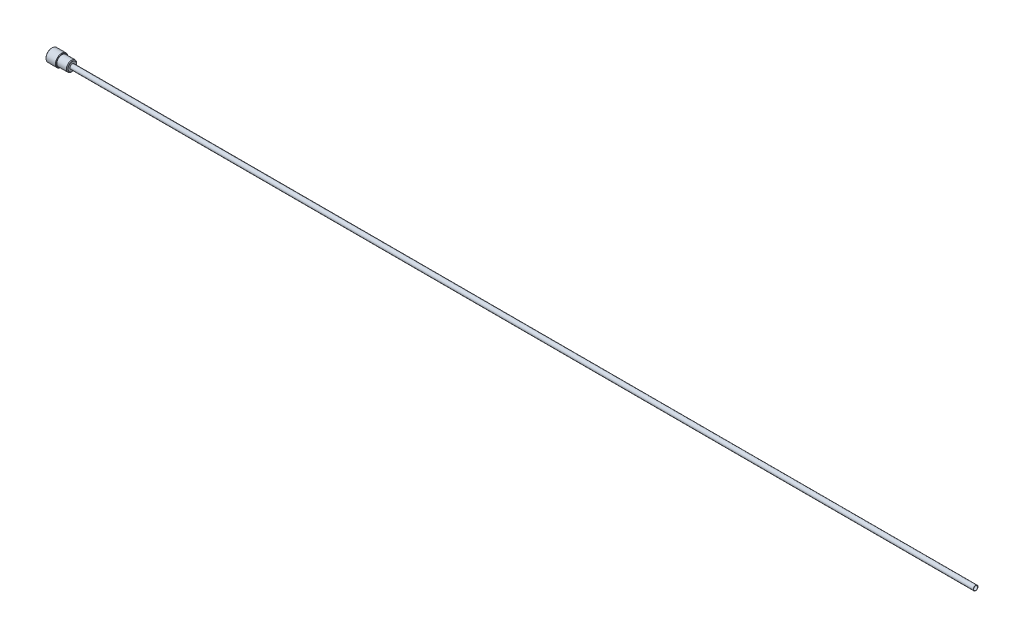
ISO-10303-21;
HEADER;
FILE_DESCRIPTION(('STEP AP214'),'2;1');
FILE_NAME('part.step','',(''),(''),'','','');
FILE_SCHEMA(('AUTOMOTIVE_DESIGN { 1 0 10303 214 1 1 1 1 }'));
ENDSEC;
DATA;
#1=APPLICATION_CONTEXT('core data for automotive mechanical design processes');
#2=APPLICATION_PROTOCOL_DEFINITION('international standard','automotive_design',2000,#1);
#3=PRODUCT_CONTEXT('',#1,'mechanical');
#4=PRODUCT('Part','Part','',(#3));
#5=PRODUCT_RELATED_PRODUCT_CATEGORY('part','',(#4));
#6=PRODUCT_DEFINITION_FORMATION('','',#4);
#7=PRODUCT_DEFINITION_CONTEXT('part definition',#1,'design');
#8=PRODUCT_DEFINITION('design','',#6,#7);
#9=PRODUCT_DEFINITION_SHAPE('','',#8);
#10=(LENGTH_UNIT() NAMED_UNIT(*) SI_UNIT(.MILLI.,.METRE.));
#11=(NAMED_UNIT(*) PLANE_ANGLE_UNIT() SI_UNIT($,.RADIAN.));
#12=(NAMED_UNIT(*) SI_UNIT($,.STERADIAN.) SOLID_ANGLE_UNIT());
#13=UNCERTAINTY_MEASURE_WITH_UNIT(LENGTH_MEASURE(1.E-05),#10,'distance_accuracy_value','');
#14=(GEOMETRIC_REPRESENTATION_CONTEXT(3) GLOBAL_UNCERTAINTY_ASSIGNED_CONTEXT((#13)) GLOBAL_UNIT_ASSIGNED_CONTEXT((#10,
#11,#12)) REPRESENTATION_CONTEXT('',''));
#15=CARTESIAN_POINT('',(0.,0.,0.));
#16=DIRECTION('',(0.,0.,1.));
#17=DIRECTION('',(1.,0.,0.));
#18=AXIS2_PLACEMENT_3D('',#15,#16,#17);
#19=CARTESIAN_POINT('',(0.300000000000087,0.,0.));
#20=DIRECTION('',(-1.,0.,0.));
#21=DIRECTION('',(0.,0.,1.));
#22=AXIS2_PLACEMENT_3D('',#19,#20,#21);
#23=CONICAL_SURFACE('',#22,2.,0.785398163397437);
#24=CARTESIAN_POINT('',(-0.000200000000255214,1.98396647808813,-1.16395749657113));
#25=CARTESIAN_POINT('',(0.0384307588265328,1.9161781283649,-1.20309511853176));
#26=CARTESIAN_POINT('',(0.0747491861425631,1.8472660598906,-1.24288151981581));
#27=CARTESIAN_POINT('',(0.141169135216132,1.70680265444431,-1.32397810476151));
#28=CARTESIAN_POINT('',(0.171234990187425,1.63523877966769,-1.36529552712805));
#29=CARTESIAN_POINT('',(0.222691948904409,1.49094484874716,-1.44860366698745));
#30=CARTESIAN_POINT('',(0.24420866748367,1.41824935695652,-1.49057442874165));
#31=CARTESIAN_POINT('',(0.277313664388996,1.27130498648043,-1.57541280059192));
#32=CARTESIAN_POINT('',(0.288925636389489,1.19706025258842,-1.61827801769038));
#33=CARTESIAN_POINT('',(0.299422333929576,1.06830579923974,-1.6926144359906));
#34=CARTESIAN_POINT('',(0.300918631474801,1.01394984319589,-1.72399686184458));
#35=CARTESIAN_POINT('',(0.297995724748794,0.905336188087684,-1.78670498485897));
#36=CARTESIAN_POINT('',(0.293574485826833,0.851078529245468,-1.81803065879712));
#37=CARTESIAN_POINT('',(0.279068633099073,0.743085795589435,-1.88038029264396));
#38=CARTESIAN_POINT('',(0.268978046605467,0.689351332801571,-1.91140389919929));
#39=CARTESIAN_POINT('',(0.243685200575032,0.582815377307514,-1.97291246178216));
#40=CARTESIAN_POINT('',(0.228483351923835,0.530013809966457,-2.00339746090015));
#41=CARTESIAN_POINT('',(0.184480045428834,0.398001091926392,-2.07961503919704));
#42=CARTESIAN_POINT('',(0.152732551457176,0.31952408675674,-2.12492375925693));
#43=CARTESIAN_POINT('',(0.0993016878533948,0.204043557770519,-2.19159647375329));
#44=CARTESIAN_POINT('',(0.0805538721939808,0.165975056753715,-2.21357533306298));
#45=CARTESIAN_POINT('',(0.0413766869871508,0.0905142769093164,-2.25714263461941));
#46=CARTESIAN_POINT('',(0.0209481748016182,0.0531216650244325,-2.27873126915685));
#47=CARTESIAN_POINT('',(-0.00020000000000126,0.0160335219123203,-2.30014411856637));
#48=B_SPLINE_CURVE_WITH_KNOTS('',3,(#24,#25,#26,#27,#28,#29,#30,#31,#32,#33,#34,#35,#36,#37,#38,
#39,#40,#41,#42,#43,#44,#45,#46,#47),.UNSPECIFIED.,.F.,.F.,(4,2,2,2,2,2,2,2,2,2,2,4),(0.,
0.262041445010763,0.525538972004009,0.785007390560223,1.04385336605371,1.23193452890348,
1.4200803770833,1.60842481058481,1.79675410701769,2.08425218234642,2.22759444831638,
2.37086404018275),.UNSPECIFIED.);
#49=CARTESIAN_POINT('',(0.,1.98361577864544,-1.16415997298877));
#50=VERTEX_POINT('',#49);
#51=CARTESIAN_POINT('',(0.,0.0163842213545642,-2.29994164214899));
#52=VERTEX_POINT('',#51);
#53=EDGE_CURVE('E11',#50,#52,#48,.T.);
#54=ORIENTED_EDGE('',*,*,#53,.F.);
#55=CARTESIAN_POINT('',(0.,0.,0.));
#56=DIRECTION('',(1.,0.,0.));
#57=DIRECTION('',(0.,0.,-1.));
#58=AXIS2_PLACEMENT_3D('',#55,#56,#57);
#59=CIRCLE('',#58,2.30000000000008);
#60=EDGE_CURVE('E309',#52,#50,#59,.T.);
#61=ORIENTED_EDGE('',*,*,#60,.F.);
#62=EDGE_LOOP('',(#54,#61));
#63=FACE_BOUND('',#62,.T.);
#64=ADVANCED_FACE('F33',(#63),#23,.F.);
#65=CARTESIAN_POINT('',(-0.828689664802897,2.,-2.40597153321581));
#66=CARTESIAN_POINT('',(-0.783988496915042,2.,-2.347829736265));
#67=CARTESIAN_POINT('',(-0.739688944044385,2.,-2.28937422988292));
#68=CARTESIAN_POINT('',(-0.652076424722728,2.,-2.17170772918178));
#69=CARTESIAN_POINT('',(-0.608763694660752,2.,-2.11249655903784));
#70=CARTESIAN_POINT('',(-0.522999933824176,2.,-1.99275792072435));
#71=CARTESIAN_POINT('',(-0.480558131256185,2.,-1.93222382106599));
#72=CARTESIAN_POINT('',(-0.397155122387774,2.,-1.81014741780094));
#73=CARTESIAN_POINT('',(-0.356193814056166,2.,-1.74860518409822));
#74=CARTESIAN_POINT('',(-0.27355167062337,2.,-1.62040759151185));
#75=CARTESIAN_POINT('',(-0.231989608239,2.,-1.55367527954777));
#76=CARTESIAN_POINT('',(-0.151462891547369,2.,-1.41866366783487));
#77=CARTESIAN_POINT('',(-0.112497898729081,2.,-1.35038457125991));
#78=CARTESIAN_POINT('',(-0.0379762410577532,2.,-1.21223217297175));
#79=CARTESIAN_POINT('',(-0.00241004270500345,2.,-1.14236405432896));
#80=CARTESIAN_POINT('',(0.0645106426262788,2.,-1.00065507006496));
#81=CARTESIAN_POINT('',(0.0958671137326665,2.,-0.928815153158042));
#82=CARTESIAN_POINT('',(0.150419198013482,2.,-0.790157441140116));
#83=CARTESIAN_POINT('',(0.174113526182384,2.,-0.723537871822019));
#84=CARTESIAN_POINT('',(0.216169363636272,2.,-0.588604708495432));
#85=CARTESIAN_POINT('',(0.234530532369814,2.,-0.520291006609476));
#86=CARTESIAN_POINT('',(0.264621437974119,2.,-0.383565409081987));
#87=CARTESIAN_POINT('',(0.276471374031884,2.,-0.315180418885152));
#88=CARTESIAN_POINT('',(0.293293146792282,2.,-0.177564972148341));
#89=CARTESIAN_POINT('',(0.298266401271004,2.,-0.108334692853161));
#90=CARTESIAN_POINT('',(0.300913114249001,2.,0.0272578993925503));
#91=CARTESIAN_POINT('',(0.29889405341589,2.,0.0936142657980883));
#92=CARTESIAN_POINT('',(0.288372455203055,2.,0.225807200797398));
#93=CARTESIAN_POINT('',(0.279869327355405,2.,0.291643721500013));
#94=CARTESIAN_POINT('',(0.256715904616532,2.,0.423437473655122));
#95=CARTESIAN_POINT('',(0.241957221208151,2.,0.489375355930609));
#96=CARTESIAN_POINT('',(0.207107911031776,2.,0.619795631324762));
#97=CARTESIAN_POINT('',(0.187017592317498,2.,0.68427810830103));
#98=CARTESIAN_POINT('',(0.117470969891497,2.,0.882854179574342));
#99=CARTESIAN_POINT('',(0.0602832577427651,2.,1.014230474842));
#100=CARTESIAN_POINT('',(-0.0669762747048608,2.,1.27085617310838));
#101=CARTESIAN_POINT('',(-0.137093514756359,2.,1.3960819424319));
#102=CARTESIAN_POINT('',(-0.246592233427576,2.,1.57710301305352));
#103=CARTESIAN_POINT('',(-0.282799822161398,2.,1.63485696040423));
#104=CARTESIAN_POINT('',(-0.356762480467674,2.,1.74937310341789));
#105=CARTESIAN_POINT('',(-0.394517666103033,2.,1.80613522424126));
#106=CARTESIAN_POINT('',(-0.47098494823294,2.,1.91834043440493));
#107=CARTESIAN_POINT('',(-0.509686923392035,2.,1.97379045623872));
#108=CARTESIAN_POINT('',(-0.588127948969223,2.,2.08392988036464));
#109=CARTESIAN_POINT('',(-0.627866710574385,2.,2.13861948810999));
#110=CARTESIAN_POINT('',(-0.668030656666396,2.,2.19299019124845));
#111=B_SPLINE_CURVE_WITH_KNOTS('',3,(#65,#66,#67,#68,#69,#70,#71,#72,#73,#74,#75,#76,#77,#78,
#79,#80,#81,#82,#83,#84,#85,#86,#87,#88,#89,#90,#91,#92,#93,#94,#95,#96,#97,#98,#99,#100,#101,
#102,#103,#104,#105,#106,#107,#108,#109,#110),.UNSPECIFIED.,.F.,.F.,(4,2,2,2,2,2,2,2,2,2,2,2,2,
2,2,2,2,2,2,2,2,2,4),(0.,0.220022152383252,0.440096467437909,0.661868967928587,
0.883626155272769,1.11943006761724,1.35520318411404,1.59029425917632,1.82527413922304,
2.03721449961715,2.24916839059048,2.45706548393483,2.66491970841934,2.86375194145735,
3.06260228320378,3.26504876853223,3.46748355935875,3.89608923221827,4.32623026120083,
4.53070681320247,4.73519872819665,4.93804819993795,5.14084175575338),.UNSPECIFIED.);
#112=CARTESIAN_POINT('',(0.,2.,1.13578166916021));
#113=VERTEX_POINT('',#112);
#114=CARTESIAN_POINT('',(0.,2.,-1.13578166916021));
#115=VERTEX_POINT('',#114);
#116=EDGE_CURVE('E46',#113,#115,#111,.F.);
#117=ORIENTED_EDGE('',*,*,#116,.F.);
#118=EDGE_CURVE('E311',#115,#113,#59,.T.);
#119=ORIENTED_EDGE('',*,*,#118,.F.);
#120=EDGE_LOOP('',(#117,#119));
#121=FACE_BOUND('',#120,.T.);
#122=ADVANCED_FACE('F275',(#121),#23,.F.);
#123=CARTESIAN_POINT('',(-0.000200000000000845,0.016033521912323,2.30014411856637));
#124=CARTESIAN_POINT('',(0.0384307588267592,0.0838218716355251,2.26100649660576));
#125=CARTESIAN_POINT('',(0.0747491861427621,0.152733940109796,2.22122009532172));
#126=CARTESIAN_POINT('',(0.141169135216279,0.293197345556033,2.14012351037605));
#127=CARTESIAN_POINT('',(0.171234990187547,0.364761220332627,2.09880608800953));
#128=CARTESIAN_POINT('',(0.222691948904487,0.509055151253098,2.01549794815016));
#129=CARTESIAN_POINT('',(0.244208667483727,0.581750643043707,1.97352718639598));
#130=CARTESIAN_POINT('',(0.277313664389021,0.728695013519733,1.88868881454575));
#131=CARTESIAN_POINT('',(0.288925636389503,0.802939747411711,1.84582359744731));
#132=CARTESIAN_POINT('',(0.29942233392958,0.931694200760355,1.7714871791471));
#133=CARTESIAN_POINT('',(0.300918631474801,0.9860501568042,1.74010475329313));
#134=CARTESIAN_POINT('',(0.297995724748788,1.0946638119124,1.67739663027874));
#135=CARTESIAN_POINT('',(0.293574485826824,1.14892147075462,1.64607095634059));
#136=CARTESIAN_POINT('',(0.279068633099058,1.25691420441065,1.58372132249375));
#137=CARTESIAN_POINT('',(0.268978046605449,1.31064866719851,1.55269771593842));
#138=CARTESIAN_POINT('',(0.24368520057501,1.41718462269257,1.49118915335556));
#139=CARTESIAN_POINT('',(0.228483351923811,1.46998619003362,1.46070415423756));
#140=CARTESIAN_POINT('',(0.184480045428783,1.60199890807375,1.38448657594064));
#141=CARTESIAN_POINT('',(0.15273255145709,1.68047591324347,1.33917785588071));
#142=CARTESIAN_POINT('',(0.0993016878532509,1.79595644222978,1.2725051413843));
#143=CARTESIAN_POINT('',(0.0805538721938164,1.83402494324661,1.25052628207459));
#144=CARTESIAN_POINT('',(0.0413766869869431,1.90948572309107,1.20695898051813));
#145=CARTESIAN_POINT('',(0.0209481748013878,1.94687833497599,1.18537034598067));
#146=CARTESIAN_POINT('',(-0.000200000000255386,1.98396647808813,1.16395749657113));
#147=B_SPLINE_CURVE_WITH_KNOTS('',3,(#123,#124,#125,#126,#127,#128,#129,#130,#131,#132,#133,
#134,#135,#136,#137,#138,#139,#140,#141,#142,#143,#144,#145,#146),.UNSPECIFIED.,.F.,.F.,(4,2,2,
2,2,2,2,2,2,2,2,4),(0.,0.262041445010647,0.525538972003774,0.785007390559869,1.04385336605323,
1.23193452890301,1.42008037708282,1.60842481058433,1.7967541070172,2.08425218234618,
2.22759444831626,2.37086404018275),.UNSPECIFIED.);
#148=CARTESIAN_POINT('',(0.,0.0163842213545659,2.29994164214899));
#149=VERTEX_POINT('',#148);
#150=CARTESIAN_POINT('',(0.,1.98361577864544,1.16415997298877));
#151=VERTEX_POINT('',#150);
#152=EDGE_CURVE('E245',#149,#151,#147,.T.);
#153=ORIENTED_EDGE('',*,*,#152,.F.);
#154=EDGE_CURVE('E307',#151,#149,#59,.T.);
#155=ORIENTED_EDGE('',*,*,#154,.F.);
#156=EDGE_LOOP('',(#153,#155));
#157=FACE_BOUND('',#156,.T.);
#158=ADVANCED_FACE('F280',(#157),#23,.F.);
#159=CARTESIAN_POINT('',(-0.000200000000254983,-1.98396647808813,1.16395749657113));
#160=CARTESIAN_POINT('',(0.0384307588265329,-1.9161781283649,1.20309511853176));
#161=CARTESIAN_POINT('',(0.0747491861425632,-1.8472660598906,1.24288151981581));
#162=CARTESIAN_POINT('',(0.141169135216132,-1.70680265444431,1.32397810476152));
#163=CARTESIAN_POINT('',(0.171234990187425,-1.63523877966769,1.36529552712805));
#164=CARTESIAN_POINT('',(0.222691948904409,-1.49094484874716,1.44860366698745));
#165=CARTESIAN_POINT('',(0.24420866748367,-1.41824935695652,1.49057442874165));
#166=CARTESIAN_POINT('',(0.277313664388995,-1.27130498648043,1.57541280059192));
#167=CARTESIAN_POINT('',(0.288925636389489,-1.19706025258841,1.61827801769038));
#168=CARTESIAN_POINT('',(0.299422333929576,-1.06830579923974,1.69261443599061));
#169=CARTESIAN_POINT('',(0.300918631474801,-1.01394984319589,1.72399686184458));
#170=CARTESIAN_POINT('',(0.297995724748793,-0.905336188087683,1.78670498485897));
#171=CARTESIAN_POINT('',(0.293574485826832,-0.851078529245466,1.81803065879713));
#172=CARTESIAN_POINT('',(0.279068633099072,-0.743085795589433,1.88038029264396));
#173=CARTESIAN_POINT('',(0.268978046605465,-0.689351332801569,1.91140389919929));
#174=CARTESIAN_POINT('',(0.243685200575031,-0.582815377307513,1.97291246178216));
#175=CARTESIAN_POINT('',(0.228483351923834,-0.530013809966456,2.00339746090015));
#176=CARTESIAN_POINT('',(0.184480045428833,-0.398001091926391,2.07961503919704));
#177=CARTESIAN_POINT('',(0.152732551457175,-0.31952408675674,2.12492375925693));
#178=CARTESIAN_POINT('',(0.0993016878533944,-0.204043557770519,2.19159647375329));
#179=CARTESIAN_POINT('',(0.0805538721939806,-0.165975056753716,2.21357533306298));
#180=CARTESIAN_POINT('',(0.0413766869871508,-0.0905142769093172,2.25714263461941));
#181=CARTESIAN_POINT('',(0.0209481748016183,-0.0531216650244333,2.27873126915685));
#182=CARTESIAN_POINT('',(-0.000200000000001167,-0.0160335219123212,2.30014411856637));
#183=B_SPLINE_CURVE_WITH_KNOTS('',3,(#159,#160,#161,#162,#163,#164,#165,#166,#167,#168,#169,
#170,#171,#172,#173,#174,#175,#176,#177,#178,#179,#180,#181,#182),.UNSPECIFIED.,.F.,.F.,(4,2,2,
2,2,2,2,2,2,2,2,4),(0.,0.262041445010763,0.525538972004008,0.785007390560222,1.0438533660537,
1.23193452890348,1.4200803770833,1.60842481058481,1.79675410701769,2.08425218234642,
2.22759444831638,2.37086404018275),.UNSPECIFIED.);
#184=CARTESIAN_POINT('',(0.,-1.98361577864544,1.16415997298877));
#185=VERTEX_POINT('',#184);
#186=CARTESIAN_POINT('',(0.,-0.0163842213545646,2.29994164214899));
#187=VERTEX_POINT('',#186);
#188=EDGE_CURVE('E250',#185,#187,#183,.T.);
#189=ORIENTED_EDGE('',*,*,#188,.F.);
#190=EDGE_CURVE('E304',#187,#185,#59,.T.);
#191=ORIENTED_EDGE('',*,*,#190,.F.);
#192=EDGE_LOOP('',(#189,#191));
#193=FACE_BOUND('',#192,.T.);
#194=ADVANCED_FACE('F288',(#193),#23,.F.);
#195=CARTESIAN_POINT('',(-0.828689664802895,-2.,-2.4059715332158));
#196=CARTESIAN_POINT('',(-0.783988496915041,-2.,-2.34782973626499));
#197=CARTESIAN_POINT('',(-0.739688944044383,-2.,-2.28937422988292));
#198=CARTESIAN_POINT('',(-0.652076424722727,-2.,-2.17170772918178));
#199=CARTESIAN_POINT('',(-0.608763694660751,-2.,-2.11249655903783));
#200=CARTESIAN_POINT('',(-0.522999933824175,-2.,-1.99275792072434));
#201=CARTESIAN_POINT('',(-0.480558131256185,-2.,-1.93222382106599));
#202=CARTESIAN_POINT('',(-0.397155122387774,-2.,-1.81014741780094));
#203=CARTESIAN_POINT('',(-0.356193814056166,-2.,-1.74860518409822));
#204=CARTESIAN_POINT('',(-0.27355167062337,-2.,-1.62040759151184));
#205=CARTESIAN_POINT('',(-0.231989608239,-2.,-1.55367527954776));
#206=CARTESIAN_POINT('',(-0.151462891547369,-2.,-1.41866366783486));
#207=CARTESIAN_POINT('',(-0.112497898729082,-2.,-1.35038457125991));
#208=CARTESIAN_POINT('',(-0.0379762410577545,-2.,-1.21223217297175));
#209=CARTESIAN_POINT('',(-0.00241004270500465,-2.,-1.14236405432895));
#210=CARTESIAN_POINT('',(0.0645106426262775,-2.,-1.00065507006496));
#211=CARTESIAN_POINT('',(0.095867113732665,-2.,-0.928815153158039));
#212=CARTESIAN_POINT('',(0.15041919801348,-2.,-0.790157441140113));
#213=CARTESIAN_POINT('',(0.174113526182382,-2.,-0.723537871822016));
#214=CARTESIAN_POINT('',(0.21616936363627,-2.,-0.588604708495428));
#215=CARTESIAN_POINT('',(0.234530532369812,-2.,-0.520291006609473));
#216=CARTESIAN_POINT('',(0.264621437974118,-2.,-0.383565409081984));
#217=CARTESIAN_POINT('',(0.276471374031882,-2.,-0.315180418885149));
#218=CARTESIAN_POINT('',(0.29329314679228,-2.,-0.177564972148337));
#219=CARTESIAN_POINT('',(0.298266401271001,-2.,-0.108334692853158));
#220=CARTESIAN_POINT('',(0.300913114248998,-2.,0.0272578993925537));
#221=CARTESIAN_POINT('',(0.298894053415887,-2.,0.0936142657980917));
#222=CARTESIAN_POINT('',(0.288372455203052,-2.,0.225807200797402));
#223=CARTESIAN_POINT('',(0.279869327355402,-2.,0.291643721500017));
#224=CARTESIAN_POINT('',(0.256715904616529,-2.,0.423437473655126));
#225=CARTESIAN_POINT('',(0.241957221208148,-2.,0.489375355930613));
#226=CARTESIAN_POINT('',(0.207107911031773,-2.,0.619795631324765));
#227=CARTESIAN_POINT('',(0.187017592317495,-2.,0.684278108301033));
#228=CARTESIAN_POINT('',(0.117470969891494,-2.,0.882854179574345));
#229=CARTESIAN_POINT('',(0.0602832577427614,-2.,1.014230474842));
#230=CARTESIAN_POINT('',(-0.0669762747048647,-2.,1.27085617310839));
#231=CARTESIAN_POINT('',(-0.137093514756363,-2.,1.3960819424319));
#232=CARTESIAN_POINT('',(-0.24659223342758,-2.,1.57710301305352));
#233=CARTESIAN_POINT('',(-0.282799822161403,-2.,1.63485696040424));
#234=CARTESIAN_POINT('',(-0.356762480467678,-2.,1.7493731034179));
#235=CARTESIAN_POINT('',(-0.394517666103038,-2.,1.80613522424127));
#236=CARTESIAN_POINT('',(-0.470984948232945,-2.,1.91834043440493));
#237=CARTESIAN_POINT('',(-0.509686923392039,-2.,1.97379045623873));
#238=CARTESIAN_POINT('',(-0.588127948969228,-2.,2.08392988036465));
#239=CARTESIAN_POINT('',(-0.62786671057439,-2.,2.13861948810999));
#240=CARTESIAN_POINT('',(-0.668030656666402,-2.,2.19299019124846));
#241=B_SPLINE_CURVE_WITH_KNOTS('',3,(#195,#196,#197,#198,#199,#200,#201,#202,#203,#204,#205,
#206,#207,#208,#209,#210,#211,#212,#213,#214,#215,#216,#217,#218,#219,#220,#221,#222,#223,#224,
#225,#226,#227,#228,#229,#230,#231,#232,#233,#234,#235,#236,#237,#238,#239,#240),.UNSPECIFIED.,
.F.,.F.,(4,2,2,2,2,2,2,2,2,2,2,2,2,2,2,2,2,2,2,2,2,2,4),(0.,0.220022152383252,0.440096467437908,
0.661868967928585,0.883626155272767,1.11943006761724,1.35520318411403,1.59029425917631,
1.82527413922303,2.03721449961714,2.24916839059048,2.45706548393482,2.66491970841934,
2.86375194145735,3.06260228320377,3.26504876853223,3.46748355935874,3.89608923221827,
4.32623026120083,4.53070681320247,4.73519872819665,4.93804819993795,5.14084175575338),.UNSPECIFIED.);
#242=CARTESIAN_POINT('',(0.,-2.,-1.13578166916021));
#243=VERTEX_POINT('',#242);
#244=CARTESIAN_POINT('',(0.,-2.,1.13578166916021));
#245=VERTEX_POINT('',#244);
#246=EDGE_CURVE('E255',#243,#245,#241,.T.);
#247=ORIENTED_EDGE('',*,*,#246,.F.);
#248=EDGE_CURVE('E299',#245,#243,#59,.T.);
#249=ORIENTED_EDGE('',*,*,#248,.F.);
#250=EDGE_LOOP('',(#247,#249));
#251=FACE_BOUND('',#250,.T.);
#252=ADVANCED_FACE('F283',(#251),#23,.F.);
#253=CARTESIAN_POINT('',(0.,0.965199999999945,0.));
#254=DIRECTION('',(1.,0.,0.));
#255=DIRECTION('',(0.,0.,-1.));
#256=AXIS2_PLACEMENT_3D('',#253,#254,#255);
#257=PLANE('',#256);
#258=ORIENTED_EDGE('',*,*,#60,.T.);
#259=DIRECTION('',(0.,-0.866025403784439,-0.5));
#260=VECTOR('',#259,1.);
#261=CARTESIAN_POINT('',(0.,2.,-1.15470053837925));
#262=LINE('',#261,#260);
#263=CARTESIAN_POINT('',(0.,2.,-1.15470053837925));
#264=VERTEX_POINT('',#263);
#265=EDGE_CURVE('E133',#264,#50,#262,.T.);
#266=ORIENTED_EDGE('',*,*,#265,.F.);
#267=DIRECTION('',(0.,0.,-1.));
#268=VECTOR('',#267,1.);
#269=CARTESIAN_POINT('',(0.,2.,1.15470053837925));
#270=LINE('',#269,#268);
#271=EDGE_CURVE('E167',#115,#264,#270,.T.);
#272=ORIENTED_EDGE('',*,*,#271,.F.);
#273=ORIENTED_EDGE('',*,*,#118,.T.);
#274=CARTESIAN_POINT('',(0.,2.,1.15470053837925));
#275=VERTEX_POINT('',#274);
#276=EDGE_CURVE('E144',#275,#113,#270,.T.);
#277=ORIENTED_EDGE('',*,*,#276,.F.);
#278=DIRECTION('',(0.,0.866025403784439,-0.5));
#279=VECTOR('',#278,1.);
#280=CARTESIAN_POINT('',(0.,0.,2.30940107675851));
#281=LINE('',#280,#279);
#282=EDGE_CURVE('E163',#151,#275,#281,.T.);
#283=ORIENTED_EDGE('',*,*,#282,.F.);
#284=ORIENTED_EDGE('',*,*,#154,.T.);
#285=CARTESIAN_POINT('',(0.,0.,2.30940107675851));
#286=VERTEX_POINT('',#285);
#287=EDGE_CURVE('E164',#286,#149,#281,.T.);
#288=ORIENTED_EDGE('',*,*,#287,.F.);
#289=DIRECTION('',(0.,0.866025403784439,0.5));
#290=VECTOR('',#289,1.);
#291=CARTESIAN_POINT('',(0.,-2.,1.15470053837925));
#292=LINE('',#291,#290);
#293=EDGE_CURVE('E159',#187,#286,#292,.T.);
#294=ORIENTED_EDGE('',*,*,#293,.F.);
#295=ORIENTED_EDGE('',*,*,#190,.T.);
#296=CARTESIAN_POINT('',(0.,-2.,1.15470053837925));
#297=VERTEX_POINT('',#296);
#298=EDGE_CURVE('E160',#297,#185,#292,.T.);
#299=ORIENTED_EDGE('',*,*,#298,.F.);
#300=DIRECTION('',(0.,0.,1.));
#301=VECTOR('',#300,1.);
#302=CARTESIAN_POINT('',(0.,-2.,-1.15470053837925));
#303=LINE('',#302,#301);
#304=EDGE_CURVE('E151',#245,#297,#303,.T.);
#305=ORIENTED_EDGE('',*,*,#304,.F.);
#306=ORIENTED_EDGE('',*,*,#248,.T.);
#307=CARTESIAN_POINT('',(0.,-2.,-1.15470053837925));
#308=VERTEX_POINT('',#307);
#309=EDGE_CURVE('E154',#308,#243,#303,.T.);
#310=ORIENTED_EDGE('',*,*,#309,.F.);
#311=DIRECTION('',(0.,-0.866025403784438,0.5));
#312=VECTOR('',#311,1.);
#313=CARTESIAN_POINT('',(0.,0.,-2.3094010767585));
#314=LINE('',#313,#312);
#315=CARTESIAN_POINT('',(0.,-1.98361577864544,-1.16415997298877));
#316=VERTEX_POINT('',#315);
#317=EDGE_CURVE('E152',#316,#308,#314,.T.);
#318=ORIENTED_EDGE('',*,*,#317,.F.);
#319=CARTESIAN_POINT('',(0.,-0.0163842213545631,-2.29994164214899));
#320=VERTEX_POINT('',#319);
#321=EDGE_CURVE('E150',#316,#320,#59,.T.);
#322=ORIENTED_EDGE('',*,*,#321,.T.);
#323=CARTESIAN_POINT('',(0.,0.,-2.3094010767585));
#324=VERTEX_POINT('',#323);
#325=EDGE_CURVE('E139',#324,#320,#314,.T.);
#326=ORIENTED_EDGE('',*,*,#325,.F.);
#327=EDGE_CURVE('E123',#52,#324,#262,.T.);
#328=ORIENTED_EDGE('',*,*,#327,.F.);
#329=EDGE_LOOP('',(#258,#266,#272,#273,#277,#283,#284,#288,#294,#295,#299,#305,#306,#310,#318,
#322,#326,#328));
#330=FACE_BOUND('',#329,.T.);
#331=CARTESIAN_POINT('',(0.,0.,0.));
#332=DIRECTION('',(1.,0.,0.));
#333=DIRECTION('',(0.,0.,-1.));
#334=AXIS2_PLACEMENT_3D('',#331,#332,#333);
#335=CIRCLE('',#334,2.79999999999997);
#336=CARTESIAN_POINT('',(0.,0.,-2.79999999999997));
#337=VERTEX_POINT('',#336);
#338=EDGE_CURVE('E308',#337,#337,#335,.F.);
#339=ORIENTED_EDGE('',*,*,#338,.T.);
#340=EDGE_LOOP('',(#339));
#341=FACE_BOUND('',#340,.T.);
#342=ADVANCED_FACE('F146',(#330,#341),#257,.F.);
#343=CARTESIAN_POINT('',(-22.2121854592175,0.,0.));
#344=DIRECTION('',(-1.,0.,0.));
#345=DIRECTION('',(0.,0.,1.));
#346=AXIS2_PLACEMENT_3D('',#343,#344,#345);
#347=CYLINDRICAL_SURFACE('',#346,0.965199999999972);
#348=CARTESIAN_POINT('',(450.,0.,0.));
#349=DIRECTION('',(-1.,0.,0.));
#350=DIRECTION('',(0.,0.,1.));
#351=AXIS2_PLACEMENT_3D('',#348,#349,#350);
#352=CIRCLE('',#351,0.9652);
#353=CARTESIAN_POINT('',(450.,0.,0.9652));
#354=VERTEX_POINT('',#353);
#355=EDGE_CURVE('E340',#354,#354,#352,.T.);
#356=ORIENTED_EDGE('',*,*,#355,.F.);
#357=EDGE_LOOP('',(#356));
#358=FACE_BOUND('',#357,.T.);
#359=CARTESIAN_POINT('',(3.62177056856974,0.,0.));
#360=DIRECTION('',(-1.,0.,0.));
#361=DIRECTION('',(0.,0.,1.));
#362=AXIS2_PLACEMENT_3D('',#359,#360,#361);
#363=CIRCLE('',#362,0.965199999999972);
#364=CARTESIAN_POINT('',(3.62177056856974,0.,0.965199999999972));
#365=VERTEX_POINT('',#364);
#366=EDGE_CURVE('E190',#365,#365,#363,.F.);
#367=ORIENTED_EDGE('',*,*,#366,.F.);
#368=EDGE_LOOP('',(#367));
#369=FACE_BOUND('',#368,.T.);
#370=ADVANCED_FACE('F294',(#358,#369),#347,.F.);
#371=CARTESIAN_POINT('',(10.,2.05,0.));
#372=DIRECTION('',(-1.,0.,0.));
#373=DIRECTION('',(0.,0.,1.));
#374=AXIS2_PLACEMENT_3D('',#371,#372,#373);
#375=PLANE('',#374);
#376=CARTESIAN_POINT('',(10.,0.,0.));
#377=DIRECTION('',(-1.,0.,0.));
#378=DIRECTION('',(0.,0.,1.));
#379=AXIS2_PLACEMENT_3D('',#376,#377,#378);
#380=CIRCLE('',#379,2.05);
#381=CARTESIAN_POINT('',(10.,0.,2.05));
#382=VERTEX_POINT('',#381);
#383=EDGE_CURVE('E328',#382,#382,#380,.T.);
#384=ORIENTED_EDGE('',*,*,#383,.F.);
#385=EDGE_LOOP('',(#384));
#386=FACE_BOUND('',#385,.T.);
#387=CARTESIAN_POINT('',(10.,0.,0.));
#388=DIRECTION('',(-1.,0.,0.));
#389=DIRECTION('',(0.,0.,1.));
#390=AXIS2_PLACEMENT_3D('',#387,#388,#389);
#391=CIRCLE('',#390,1.143);
#392=CARTESIAN_POINT('',(10.,0.,1.143));
#393=VERTEX_POINT('',#392);
#394=EDGE_CURVE('E192',#393,#393,#391,.T.);
#395=ORIENTED_EDGE('',*,*,#394,.T.);
#396=EDGE_LOOP('',(#395));
#397=FACE_BOUND('',#396,.T.);
#398=ADVANCED_FACE('F349',(#386,#397),#375,.F.);
#399=CARTESIAN_POINT('',(-22.2121854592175,0.,0.));
#400=DIRECTION('',(-1.,0.,0.));
#401=DIRECTION('',(0.,0.,1.));
#402=AXIS2_PLACEMENT_3D('',#399,#400,#401);
#403=CYLINDRICAL_SURFACE('',#402,2.05);
#404=CARTESIAN_POINT('',(9.9,0.,0.));
#405=DIRECTION('',(-1.,0.,0.));
#406=DIRECTION('',(0.,0.,1.));
#407=AXIS2_PLACEMENT_3D('',#404,#405,#406);
#408=CIRCLE('',#407,2.05);
#409=CARTESIAN_POINT('',(9.9,0.,2.05));
#410=VERTEX_POINT('',#409);
#411=EDGE_CURVE('E331',#410,#410,#408,.T.);
#412=ORIENTED_EDGE('',*,*,#411,.F.);
#413=EDGE_LOOP('',(#412));
#414=FACE_BOUND('',#413,.T.);
#415=ORIENTED_EDGE('',*,*,#383,.T.);
#416=EDGE_LOOP('',(#415));
#417=FACE_BOUND('',#416,.T.);
#418=ADVANCED_FACE('F383',(#414,#417),#403,.T.);
#419=CARTESIAN_POINT('',(9.9,0.,0.));
#420=DIRECTION('',(-1.,0.,0.));
#421=DIRECTION('',(0.,0.,1.));
#422=AXIS2_PLACEMENT_3D('',#419,#420,#421);
#423=CONICAL_SURFACE('',#422,2.05,1.04719755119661);
#424=CARTESIAN_POINT('',(9.64019237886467,0.,0.));
#425=DIRECTION('',(-1.,0.,0.));
#426=DIRECTION('',(0.,0.,1.));
#427=AXIS2_PLACEMENT_3D('',#424,#425,#426);
#428=CIRCLE('',#427,2.5);
#429=CARTESIAN_POINT('',(9.64019237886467,0.,2.5));
#430=VERTEX_POINT('',#429);
#431=EDGE_CURVE('E334',#430,#430,#428,.T.);
#432=ORIENTED_EDGE('',*,*,#431,.F.);
#433=EDGE_LOOP('',(#432));
#434=FACE_BOUND('',#433,.T.);
#435=ORIENTED_EDGE('',*,*,#411,.T.);
#436=EDGE_LOOP('',(#435));
#437=FACE_BOUND('',#436,.T.);
#438=ADVANCED_FACE('F379',(#434,#437),#423,.T.);
#439=CARTESIAN_POINT('',(-22.2121854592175,0.,0.));
#440=DIRECTION('',(-1.,0.,0.));
#441=DIRECTION('',(0.,0.,1.));
#442=AXIS2_PLACEMENT_3D('',#439,#440,#441);
#443=CYLINDRICAL_SURFACE('',#442,2.5);
#444=CARTESIAN_POINT('',(5.,0.,0.));
#445=DIRECTION('',(-1.,0.,0.));
#446=DIRECTION('',(0.,0.,1.));
#447=AXIS2_PLACEMENT_3D('',#444,#445,#446);
#448=CIRCLE('',#447,2.5);
#449=CARTESIAN_POINT('',(5.,0.,2.5));
#450=VERTEX_POINT('',#449);
#451=EDGE_CURVE('E337',#450,#450,#448,.T.);
#452=ORIENTED_EDGE('',*,*,#451,.F.);
#453=EDGE_LOOP('',(#452));
#454=FACE_BOUND('',#453,.T.);
#455=ORIENTED_EDGE('',*,*,#431,.T.);
#456=EDGE_LOOP('',(#455));
#457=FACE_BOUND('',#456,.T.);
#458=ADVANCED_FACE('F375',(#454,#457),#443,.T.);
#459=CARTESIAN_POINT('',(5.,2.5,0.));
#460=DIRECTION('',(-1.,0.,0.));
#461=DIRECTION('',(0.,0.,1.));
#462=AXIS2_PLACEMENT_3D('',#459,#460,#461);
#463=PLANE('',#462);
#464=CARTESIAN_POINT('',(5.,0.,0.));
#465=DIRECTION('',(-1.,0.,0.));
#466=DIRECTION('',(0.,0.,1.));
#467=AXIS2_PLACEMENT_3D('',#464,#465,#466);
#468=CIRCLE('',#467,2.80000000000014);
#469=CARTESIAN_POINT('',(5.,0.,2.80000000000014));
#470=VERTEX_POINT('',#469);
#471=EDGE_CURVE('E319',#470,#470,#468,.F.);
#472=ORIENTED_EDGE('',*,*,#471,.T.);
#473=EDGE_LOOP('',(#472));
#474=FACE_BOUND('',#473,.T.);
#475=ORIENTED_EDGE('',*,*,#451,.T.);
#476=EDGE_LOOP('',(#475));
#477=FACE_BOUND('',#476,.T.);
#478=ADVANCED_FACE('F365',(#474,#477),#463,.F.);
#479=CARTESIAN_POINT('',(-22.2121854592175,0.,0.));
#480=DIRECTION('',(-1.,0.,0.));
#481=DIRECTION('',(0.,0.,1.));
#482=AXIS2_PLACEMENT_3D('',#479,#480,#481);
#483=CYLINDRICAL_SURFACE('',#482,3.);
#484=CARTESIAN_POINT('',(4.8000000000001,0.,0.));
#485=DIRECTION('',(-1.,0.,0.));
#486=DIRECTION('',(0.,0.,1.));
#487=AXIS2_PLACEMENT_3D('',#484,#485,#486);
#488=CIRCLE('',#487,3.);
#489=CARTESIAN_POINT('',(4.8000000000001,0.,3.));
#490=VERTEX_POINT('',#489);
#491=EDGE_CURVE('E322',#490,#490,#488,.T.);
#492=ORIENTED_EDGE('',*,*,#491,.T.);
#493=EDGE_LOOP('',(#492));
#494=FACE_BOUND('',#493,.T.);
#495=CARTESIAN_POINT('',(0.200000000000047,0.,0.));
#496=DIRECTION('',(1.,0.,0.));
#497=DIRECTION('',(0.,0.,-1.));
#498=AXIS2_PLACEMENT_3D('',#495,#496,#497);
#499=CIRCLE('',#498,3.);
#500=CARTESIAN_POINT('',(0.200000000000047,0.,-3.));
#501=VERTEX_POINT('',#500);
#502=EDGE_CURVE('E325',#501,#501,#499,.T.);
#503=ORIENTED_EDGE('',*,*,#502,.T.);
#504=EDGE_LOOP('',(#503));
#505=FACE_BOUND('',#504,.T.);
#506=ADVANCED_FACE('F360',(#494,#505),#483,.T.);
#507=CARTESIAN_POINT('',(450.,1.143,0.));
#508=DIRECTION('',(-1.,0.,0.));
#509=DIRECTION('',(0.,0.,1.));
#510=AXIS2_PLACEMENT_3D('',#507,#508,#509);
#511=PLANE('',#510);
#512=CARTESIAN_POINT('',(450.,0.,0.));
#513=DIRECTION('',(-1.,0.,0.));
#514=DIRECTION('',(0.,0.,1.));
#515=AXIS2_PLACEMENT_3D('',#512,#513,#514);
#516=CIRCLE('',#515,1.143);
#517=CARTESIAN_POINT('',(450.,0.,1.143));
#518=VERTEX_POINT('',#517);
#519=EDGE_CURVE('E342',#518,#518,#516,.T.);
#520=ORIENTED_EDGE('',*,*,#519,.F.);
#521=EDGE_LOOP('',(#520));
#522=FACE_BOUND('',#521,.T.);
#523=ORIENTED_EDGE('',*,*,#355,.T.);
#524=EDGE_LOOP('',(#523));
#525=FACE_BOUND('',#524,.T.);
#526=ADVANCED_FACE('F353',(#522,#525),#511,.F.);
#527=CARTESIAN_POINT('',(-22.2121854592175,0.,0.));
#528=DIRECTION('',(-1.,0.,0.));
#529=DIRECTION('',(0.,0.,1.));
#530=AXIS2_PLACEMENT_3D('',#527,#528,#529);
#531=CYLINDRICAL_SURFACE('',#530,1.143);
#532=ORIENTED_EDGE('',*,*,#394,.F.);
#533=EDGE_LOOP('',(#532));
#534=FACE_BOUND('',#533,.T.);
#535=ORIENTED_EDGE('',*,*,#519,.T.);
#536=EDGE_LOOP('',(#535));
#537=FACE_BOUND('',#536,.T.);
#538=ADVANCED_FACE('F203',(#534,#537),#531,.T.);
#539=CARTESIAN_POINT('',(4.8000000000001,0.,0.));
#540=DIRECTION('',(-1.,0.,0.));
#541=DIRECTION('',(0.,0.,1.));
#542=AXIS2_PLACEMENT_3D('',#539,#540,#541);
#543=CONICAL_SURFACE('',#542,3.,0.785398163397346);
#544=ORIENTED_EDGE('',*,*,#471,.F.);
#545=EDGE_LOOP('',(#544));
#546=FACE_BOUND('',#545,.T.);
#547=ORIENTED_EDGE('',*,*,#491,.F.);
#548=EDGE_LOOP('',(#547));
#549=FACE_BOUND('',#548,.T.);
#550=ADVANCED_FACE('F352',(#546,#549),#543,.T.);
#551=CARTESIAN_POINT('',(0.,0.,0.));
#552=DIRECTION('',(1.,0.,0.));
#553=DIRECTION('',(0.,0.,-1.));
#554=AXIS2_PLACEMENT_3D('',#551,#552,#553);
#555=CONICAL_SURFACE('',#554,2.79999999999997,0.785398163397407);
#556=ORIENTED_EDGE('',*,*,#502,.F.);
#557=EDGE_LOOP('',(#556));
#558=FACE_BOUND('',#557,.T.);
#559=ORIENTED_EDGE('',*,*,#338,.F.);
#560=EDGE_LOOP('',(#559));
#561=FACE_BOUND('',#560,.T.);
#562=ADVANCED_FACE('F200',(#558,#561),#555,.T.);
#563=CARTESIAN_POINT('',(4.20172123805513,0.,0.));
#564=DIRECTION('',(-1.,0.,0.));
#565=DIRECTION('',(0.,0.,1.));
#566=AXIS2_PLACEMENT_3D('',#563,#564,#565);
#567=CONICAL_SURFACE('',#566,0.,1.02974425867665);
#568=CARTESIAN_POINT('',(2.81402369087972,0.000200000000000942,2.30951654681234));
#569=CARTESIAN_POINT('',(2.8446368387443,-0.0880095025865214,2.25858876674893));
#570=CARTESIAN_POINT('',(2.87249136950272,-0.177043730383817,2.20718483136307));
#571=CARTESIAN_POINT('',(2.92109863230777,-0.356787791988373,2.10340954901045));
#572=CARTESIAN_POINT('',(2.9418323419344,-0.447501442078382,2.05103599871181));
#573=CARTESIAN_POINT('',(2.97399615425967,-0.627710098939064,1.94699248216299));
#574=CARTESIAN_POINT('',(2.98566095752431,-0.717172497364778,1.89534134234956));
#575=CARTESIAN_POINT('',(2.99944227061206,-0.896543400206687,1.79178150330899));
#576=CARTESIAN_POINT('',(3.00157175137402,-0.986451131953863,1.73987325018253));
#577=CARTESIAN_POINT('',(2.99647797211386,-1.15365551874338,1.64333775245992));
#578=CARTESIAN_POINT('',(2.99050267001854,-1.23098331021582,1.59869253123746));
#579=CARTESIAN_POINT('',(2.97178402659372,-1.38509095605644,1.5097184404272));
#580=CARTESIAN_POINT('',(2.95903385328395,-1.4618701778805,1.46538993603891));
#581=CARTESIAN_POINT('',(2.92724248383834,-1.61631257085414,1.3762225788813));
#582=CARTESIAN_POINT('',(2.90805836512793,-1.69395308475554,1.3313968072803));
#583=CARTESIAN_POINT('',(2.8645945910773,-1.84798935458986,1.24246392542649));
#584=CARTESIAN_POINT('',(2.84032593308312,-1.92438741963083,1.19835548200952));
#585=CARTESIAN_POINT('',(2.81402369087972,-2.0002,1.15458506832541));
#586=B_SPLINE_CURVE_WITH_KNOTS('',3,(#568,#569,#570,#571,#572,#573,#574,#575,#576,#577,#578,
#579,#580,#581,#582,#583,#584,#585),.UNSPECIFIED.,.F.,.F.,(4,2,2,2,2,2,2,2,4),(0.,
0.319210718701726,0.639267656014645,0.950737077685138,1.26178267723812,1.5299808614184,
1.79845001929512,2.07332850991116,2.34761849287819),.UNSPECIFIED.);
#587=CARTESIAN_POINT('',(2.81409307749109,0.,2.30940107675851));
#588=VERTEX_POINT('',#587);
#589=CARTESIAN_POINT('',(2.81409307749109,-2.,1.15470053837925));
#590=VERTEX_POINT('',#589);
#591=EDGE_CURVE('E215',#588,#590,#586,.T.);
#592=ORIENTED_EDGE('',*,*,#591,.F.);
#593=CARTESIAN_POINT('',(2.81402369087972,2.0002,1.15458506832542));
#594=CARTESIAN_POINT('',(2.8446368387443,1.91199049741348,1.20551284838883));
#595=CARTESIAN_POINT('',(2.87249136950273,1.82295626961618,1.25691678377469));
#596=CARTESIAN_POINT('',(2.92109863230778,1.64321220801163,1.36069206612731));
#597=CARTESIAN_POINT('',(2.9418323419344,1.55249855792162,1.41306561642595));
#598=CARTESIAN_POINT('',(2.97399615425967,1.37228990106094,1.51710913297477));
#599=CARTESIAN_POINT('',(2.98566095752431,1.28282750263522,1.5687602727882));
#600=CARTESIAN_POINT('',(2.99944227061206,1.10345659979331,1.67232011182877));
#601=CARTESIAN_POINT('',(3.00157175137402,1.01354886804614,1.72422836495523));
#602=CARTESIAN_POINT('',(2.99647797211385,0.846344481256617,1.82076386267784));
#603=CARTESIAN_POINT('',(2.99050267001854,0.769016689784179,1.8654090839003));
#604=CARTESIAN_POINT('',(2.97178402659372,0.614909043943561,1.95438317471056));
#605=CARTESIAN_POINT('',(2.95903385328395,0.538129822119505,1.99871167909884));
#606=CARTESIAN_POINT('',(2.92724248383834,0.383687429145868,2.08787903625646));
#607=CARTESIAN_POINT('',(2.90805836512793,0.306046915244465,2.13270480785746));
#608=CARTESIAN_POINT('',(2.8645945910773,0.15201064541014,2.22163768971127));
#609=CARTESIAN_POINT('',(2.84032593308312,0.0756125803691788,2.26574613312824));
#610=CARTESIAN_POINT('',(2.81402369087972,-0.000199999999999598,2.30951654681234));
#611=B_SPLINE_CURVE_WITH_KNOTS('',3,(#593,#594,#595,#596,#597,#598,#599,#600,#601,#602,#603,
#604,#605,#606,#607,#608,#609,#610),.UNSPECIFIED.,.F.,.F.,(4,2,2,2,2,2,2,2,4),(0.,
0.319210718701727,0.639267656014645,0.950737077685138,1.26178267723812,1.5299808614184,
1.79845001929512,2.07332850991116,2.34761849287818),.UNSPECIFIED.);
#612=CARTESIAN_POINT('',(2.81409307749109,2.,1.15470053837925));
#613=VERTEX_POINT('',#612);
#614=EDGE_CURVE('E221',#613,#588,#611,.T.);
#615=ORIENTED_EDGE('',*,*,#614,.F.);
#616=CARTESIAN_POINT('',(1.96318663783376,2.,-3.14319932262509));
#617=CARTESIAN_POINT('',(2.00747994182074,2.,-3.0558020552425));
#618=CARTESIAN_POINT('',(2.0513689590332,2.,-2.96819643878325));
#619=CARTESIAN_POINT('',(2.13811109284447,2.,-2.79245728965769));
#620=CARTESIAN_POINT('',(2.18096404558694,2.,-2.70432367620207));
#621=CARTESIAN_POINT('',(2.26562767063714,2.,-2.52695236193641));
#622=CARTESIAN_POINT('',(2.30743121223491,2.,-2.43771124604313));
#623=CARTESIAN_POINT('',(2.38941270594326,2.,-2.2584882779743));
#624=CARTESIAN_POINT('',(2.42959073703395,2.,-2.16850646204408));
#625=CARTESIAN_POINT('',(2.50929441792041,2.,-1.98440398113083));
#626=CARTESIAN_POINT('',(2.54874497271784,2.,-1.89025063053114));
#627=CARTESIAN_POINT('',(2.62479925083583,2.,-1.70077974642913));
#628=CARTESIAN_POINT('',(2.66140263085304,2.,-1.60546207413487));
#629=CARTESIAN_POINT('',(2.73082504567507,2.,-1.41367065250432));
#630=CARTESIAN_POINT('',(2.7636518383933,2.,-1.31719973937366));
#631=CARTESIAN_POINT('',(2.82448907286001,2.,-1.12276519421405));
#632=CARTESIAN_POINT('',(2.85250111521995,2.,-1.02480207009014));
#633=CARTESIAN_POINT('',(2.90222299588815,2.,-0.82784330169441));
#634=CARTESIAN_POINT('',(2.92396723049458,2.,-0.728856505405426));
#635=CARTESIAN_POINT('',(2.95990752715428,2.,-0.529503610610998));
#636=CARTESIAN_POINT('',(2.97410475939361,2.,-0.429137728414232));
#637=CARTESIAN_POINT('',(2.99358086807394,2.,-0.228993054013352));
#638=CARTESIAN_POINT('',(2.99898646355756,2.,-0.129226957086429));
#639=CARTESIAN_POINT('',(3.00075354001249,2.,0.0703895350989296));
#640=CARTESIAN_POINT('',(2.9971144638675,2.,0.1702399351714));
#641=CARTESIAN_POINT('',(2.97863685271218,2.,0.400204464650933));
#642=CARTESIAN_POINT('',(2.96066539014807,2.,0.530066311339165));
#643=CARTESIAN_POINT('',(2.91230802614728,2.,0.787490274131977));
#644=CARTESIAN_POINT('',(2.88190950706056,2.,0.91504991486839));
#645=CARTESIAN_POINT('',(2.82891985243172,2.,1.1060105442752));
#646=CARTESIAN_POINT('',(2.80973860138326,2.,1.17039673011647));
#647=CARTESIAN_POINT('',(2.76931645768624,2.,1.29848127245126));
#648=CARTESIAN_POINT('',(2.74807674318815,2.,1.3621799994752));
#649=CARTESIAN_POINT('',(2.70385952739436,2.,1.48896593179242));
#650=CARTESIAN_POINT('',(2.68088205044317,2.,1.55205314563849));
#651=CARTESIAN_POINT('',(2.6334600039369,2.,1.67768077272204));
#652=CARTESIAN_POINT('',(2.60901524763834,2.,1.74022111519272));
#653=CARTESIAN_POINT('',(2.52538799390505,2.,1.94813496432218));
#654=CARTESIAN_POINT('',(2.46347620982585,2.,2.09241057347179));
#655=CARTESIAN_POINT('',(2.33514808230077,2.,2.37895382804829));
#656=CARTESIAN_POINT('',(2.26873064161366,2.,2.52122097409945));
#657=CARTESIAN_POINT('',(2.13271440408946,2.,2.80432974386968));
#658=CARTESIAN_POINT('',(2.06311364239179,2.,2.94517041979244));
#659=CARTESIAN_POINT('',(1.92165887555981,2.,3.22571857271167));
#660=CARTESIAN_POINT('',(1.84980476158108,2.,3.36542599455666));
#661=CARTESIAN_POINT('',(1.70425002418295,2.,3.64433766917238));
#662=CARTESIAN_POINT('',(1.6305450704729,2.,3.78353965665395));
#663=CARTESIAN_POINT('',(1.48187556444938,2.,4.06127015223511));
#664=CARTESIAN_POINT('',(1.4069109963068,2.,4.19979865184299));
#665=CARTESIAN_POINT('',(1.18064417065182,2.,4.61448370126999));
#666=CARTESIAN_POINT('',(1.02790708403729,2.,4.88985671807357));
#667=CARTESIAN_POINT('',(0.742823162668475,2.,5.39862538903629));
#668=CARTESIAN_POINT('',(0.610802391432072,2.,5.63220468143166));
#669=CARTESIAN_POINT('',(0.345509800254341,2.,6.09868901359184));
#670=CARTESIAN_POINT('',(0.21223783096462,2.,6.33159396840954));
#671=CARTESIAN_POINT('',(-0.0545518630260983,2.,6.79575948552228));
#672=CARTESIAN_POINT('',(-0.188065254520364,2.,7.02702254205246));
#673=CARTESIAN_POINT('',(-0.455755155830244,2.,7.48912325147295));
#674=CARTESIAN_POINT('',(-0.589931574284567,2.,7.71996095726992));
#675=CARTESIAN_POINT('',(-0.724345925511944,2.,7.95065933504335));
#676=B_SPLINE_CURVE_WITH_KNOTS('',3,(#616,#617,#618,#619,#620,#621,#622,#623,#624,#625,#626,
#627,#628,#629,#630,#631,#632,#633,#634,#635,#636,#637,#638,#639,#640,#641,#642,#643,#644,#645,
#646,#647,#648,#649,#650,#651,#652,#653,#654,#655,#656,#657,#658,#659,#660,#661,#662,#663,#664,
#665,#666,#667,#668,#669,#670,#671,#672,#673,#674,#675),.UNSPECIFIED.,.F.,.F.,(4,2,2,2,2,2,2,2,
2,2,2,2,2,2,2,2,2,2,2,2,2,2,2,2,2,2,2,2,2,4),(0.,0.293945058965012,0.587936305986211,
0.883564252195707,1.17917781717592,1.48539493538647,1.79164891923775,2.09726211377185,
2.40277351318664,2.70657494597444,3.0103292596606,3.30966528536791,3.60901974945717,
4.00153613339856,4.39445204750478,4.59597297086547,4.79737922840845,4.99878266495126,
5.20021178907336,5.67107250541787,6.14204830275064,6.61331883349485,7.08461216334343,
7.55713568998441,8.02966515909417,8.97432753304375,9.77924583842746,10.584261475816,
11.3853694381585,12.186369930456),.UNSPECIFIED.);
#677=CARTESIAN_POINT('',(2.81409307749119,2.,-1.15470053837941));
#678=VERTEX_POINT('',#677);
#679=EDGE_CURVE('E227',#678,#613,#676,.T.);
#680=ORIENTED_EDGE('',*,*,#679,.F.);
#681=CARTESIAN_POINT('',(2.81402369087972,-0.000199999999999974,-2.30951654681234));
#682=CARTESIAN_POINT('',(2.8446368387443,0.0880095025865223,-2.25858876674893));
#683=CARTESIAN_POINT('',(2.87249136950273,0.177043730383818,-2.20718483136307));
#684=CARTESIAN_POINT('',(2.92109863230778,0.356787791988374,-2.10340954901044));
#685=CARTESIAN_POINT('',(2.9418323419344,0.447501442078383,-2.0510359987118));
#686=CARTESIAN_POINT('',(2.97399615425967,0.627710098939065,-1.94699248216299));
#687=CARTESIAN_POINT('',(2.98566095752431,0.717172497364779,-1.89534134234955));
#688=CARTESIAN_POINT('',(2.99944227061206,0.896543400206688,-1.79178150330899));
#689=CARTESIAN_POINT('',(3.00157175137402,0.986451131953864,-1.73987325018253));
#690=CARTESIAN_POINT('',(2.99647797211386,1.15365551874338,-1.64333775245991));
#691=CARTESIAN_POINT('',(2.99050267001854,1.23098331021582,-1.59869253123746));
#692=CARTESIAN_POINT('',(2.97178402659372,1.38509095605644,-1.5097184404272));
#693=CARTESIAN_POINT('',(2.95903385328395,1.4618701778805,-1.46538993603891));
#694=CARTESIAN_POINT('',(2.92724248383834,1.61631257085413,-1.3762225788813));
#695=CARTESIAN_POINT('',(2.90805836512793,1.69395308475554,-1.3313968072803));
#696=CARTESIAN_POINT('',(2.8645945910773,1.84798935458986,-1.24246392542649));
#697=CARTESIAN_POINT('',(2.84032593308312,1.92438741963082,-1.19835548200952));
#698=CARTESIAN_POINT('',(2.81402369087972,2.0002,-1.15458506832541));
#699=B_SPLINE_CURVE_WITH_KNOTS('',3,(#681,#682,#683,#684,#685,#686,#687,#688,#689,#690,#691,
#692,#693,#694,#695,#696,#697,#698),.UNSPECIFIED.,.F.,.F.,(4,2,2,2,2,2,2,2,4),(0.,
0.319210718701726,0.639267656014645,0.950737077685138,1.26178267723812,1.5299808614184,
1.79845001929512,2.07332850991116,2.34761849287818),.UNSPECIFIED.);
#700=CARTESIAN_POINT('',(2.81409307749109,0.,-2.3094010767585));
#701=VERTEX_POINT('',#700);
#702=EDGE_CURVE('E191',#701,#678,#699,.T.);
#703=ORIENTED_EDGE('',*,*,#702,.F.);
#704=CARTESIAN_POINT('',(2.81402369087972,-2.0002,-1.15458506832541));
#705=CARTESIAN_POINT('',(2.8446368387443,-1.91199049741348,-1.20551284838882));
#706=CARTESIAN_POINT('',(2.87249136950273,-1.82295626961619,-1.25691678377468));
#707=CARTESIAN_POINT('',(2.92109863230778,-1.64321220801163,-1.36069206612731));
#708=CARTESIAN_POINT('',(2.9418323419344,-1.55249855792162,-1.41306561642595));
#709=CARTESIAN_POINT('',(2.97399615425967,-1.37228990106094,-1.51710913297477));
#710=CARTESIAN_POINT('',(2.98566095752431,-1.28282750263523,-1.5687602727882));
#711=CARTESIAN_POINT('',(2.99944227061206,-1.10345659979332,-1.67232011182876));
#712=CARTESIAN_POINT('',(3.00157175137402,-1.01354886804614,-1.72422836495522));
#713=CARTESIAN_POINT('',(2.99647797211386,-0.84634448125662,-1.82076386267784));
#714=CARTESIAN_POINT('',(2.99050267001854,-0.769016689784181,-1.86540908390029));
#715=CARTESIAN_POINT('',(2.97178402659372,-0.614909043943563,-1.95438317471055));
#716=CARTESIAN_POINT('',(2.95903385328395,-0.538129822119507,-1.99871167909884));
#717=CARTESIAN_POINT('',(2.92724248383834,-0.383687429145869,-2.08787903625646));
#718=CARTESIAN_POINT('',(2.90805836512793,-0.306046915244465,-2.13270480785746));
#719=CARTESIAN_POINT('',(2.8645945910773,-0.15201064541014,-2.22163768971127));
#720=CARTESIAN_POINT('',(2.84032593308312,-0.0756125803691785,-2.26574613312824));
#721=CARTESIAN_POINT('',(2.81402369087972,0.000200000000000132,-2.30951654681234));
#722=B_SPLINE_CURVE_WITH_KNOTS('',3,(#704,#705,#706,#707,#708,#709,#710,#711,#712,#713,#714,
#715,#716,#717,#718,#719,#720,#721),.UNSPECIFIED.,.F.,.F.,(4,2,2,2,2,2,2,2,4),(0.,
0.319210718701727,0.639267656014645,0.950737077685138,1.26178267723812,1.5299808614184,
1.79845001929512,2.07332850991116,2.34761849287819),.UNSPECIFIED.);
#723=CARTESIAN_POINT('',(2.81409307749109,-2.,-1.15470053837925));
#724=VERTEX_POINT('',#723);
#725=EDGE_CURVE('E142',#724,#701,#722,.T.);
#726=ORIENTED_EDGE('',*,*,#725,.F.);
#727=CARTESIAN_POINT('',(1.96318663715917,-2.,-3.14319932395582));
#728=CARTESIAN_POINT('',(2.00747994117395,-2.,-3.05580205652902));
#729=CARTESIAN_POINT('',(2.05136895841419,-2.,-2.96819644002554));
#730=CARTESIAN_POINT('',(2.13811109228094,-2.,-2.79245729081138));
#731=CARTESIAN_POINT('',(2.18096404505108,-2.,-2.70432367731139));
#732=CARTESIAN_POINT('',(2.26562767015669,-2.,-2.52695236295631));
#733=CARTESIAN_POINT('',(2.30743121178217,-2.,-2.43771124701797));
#734=CARTESIAN_POINT('',(2.38941270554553,-2.,-2.25848827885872));
#735=CARTESIAN_POINT('',(2.42959073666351,-2.,-2.16850646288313));
#736=CARTESIAN_POINT('',(2.50929441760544,-2.,-1.98440398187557));
#737=CARTESIAN_POINT('',(2.54874497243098,-2.,-1.8902506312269));
#738=CARTESIAN_POINT('',(2.62479925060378,-2.,-1.70077974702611));
#739=CARTESIAN_POINT('',(2.6614026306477,-2.,-1.60546207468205));
#740=CARTESIAN_POINT('',(2.73082504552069,-2.,-1.4136706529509));
#741=CARTESIAN_POINT('',(2.7636518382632,-2.,-1.31719973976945));
#742=CARTESIAN_POINT('',(2.82448907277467,-2.,-1.12276519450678));
#743=CARTESIAN_POINT('',(2.8525011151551,-2.,-1.0248020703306));
#744=CARTESIAN_POINT('',(2.90222299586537,-2.,-0.827843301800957));
#745=CARTESIAN_POINT('',(2.92396723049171,-2.,-0.728856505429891));
#746=CARTESIAN_POINT('',(2.95990752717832,-2.,-0.529503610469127));
#747=CARTESIAN_POINT('',(2.97410475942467,-2.,-0.429137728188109));
#748=CARTESIAN_POINT('',(2.99358086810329,-2.,-0.228993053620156));
#749=CARTESIAN_POINT('',(2.99898646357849,-2.,-0.129226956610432));
#750=CARTESIAN_POINT('',(3.00075354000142,-2.,0.0703895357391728));
#751=CARTESIAN_POINT('',(2.99711446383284,-2.,0.170239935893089));
#752=CARTESIAN_POINT('',(2.97863685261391,-2.,0.400204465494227));
#753=CARTESIAN_POINT('',(2.96066539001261,-2.,0.530066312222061));
#754=CARTESIAN_POINT('',(2.9123080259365,-2.,0.787490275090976));
#755=CARTESIAN_POINT('',(2.88190950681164,-2.,0.915049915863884));
#756=CARTESIAN_POINT('',(2.82891985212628,-2.,1.1060105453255));
#757=CARTESIAN_POINT('',(2.80973860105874,-2.,1.17039673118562));
#758=CARTESIAN_POINT('',(2.76931645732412,-2.,1.29848127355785));
#759=CARTESIAN_POINT('',(2.7480767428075,-2.,1.36218000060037));
#760=CARTESIAN_POINT('',(2.70385952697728,-2.,1.4889659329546));
#761=CARTESIAN_POINT('',(2.68088205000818,-2.,1.55205314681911));
#762=CARTESIAN_POINT('',(2.63346000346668,-2.,1.6776807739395));
#763=CARTESIAN_POINT('',(2.6090152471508,-2.,1.7402211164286));
#764=CARTESIAN_POINT('',(2.52538799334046,-2.,1.94813496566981));
#765=CARTESIAN_POINT('',(2.4634762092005,-2.,2.09241057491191));
#766=CARTESIAN_POINT('',(2.33514808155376,-2.,2.37895382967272));
#767=CARTESIAN_POINT('',(2.26873064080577,-2.,2.52122097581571));
#768=CARTESIAN_POINT('',(2.13271440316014,-2.,2.80432974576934));
#769=CARTESIAN_POINT('',(2.06311364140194,-2.,2.94517042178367));
#770=CARTESIAN_POINT('',(1.92165887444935,-2.,3.22571857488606));
#771=CARTESIAN_POINT('',(1.84980476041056,-2.,3.36542599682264));
#772=CARTESIAN_POINT('',(1.70425002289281,-2.,3.64433767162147));
#773=CARTESIAN_POINT('',(1.63054506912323,-2.,3.78353965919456));
#774=CARTESIAN_POINT('',(1.48187556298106,-2.,4.06127015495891));
#775=CARTESIAN_POINT('',(1.40691099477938,-2.,4.19979865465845));
#776=CARTESIAN_POINT('',(1.18064416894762,-2.,4.6144837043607));
#777=CARTESIAN_POINT('',(1.02790708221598,-2.,4.88985672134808));
#778=CARTESIAN_POINT('',(0.742823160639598,-2.,5.39862539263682));
#779=CARTESIAN_POINT('',(0.610802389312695,-2.,5.6322046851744));
#780=CARTESIAN_POINT('',(0.3455097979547,-2.,6.09868901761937));
#781=CARTESIAN_POINT('',(0.212237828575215,-2.,6.33159397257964));
#782=CARTESIAN_POINT('',(-0.0545518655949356,-2.,6.79575948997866));
#783=CARTESIAN_POINT('',(-0.188065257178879,-2.,7.02702254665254));
#784=CARTESIAN_POINT('',(-0.455755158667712,-2.,7.48912325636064));
#785=CARTESIAN_POINT('',(-0.589931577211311,-2.,7.71996096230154));
#786=CARTESIAN_POINT('',(-0.724345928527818,-2.,7.95065934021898));
#787=B_SPLINE_CURVE_WITH_KNOTS('',3,(#727,#728,#729,#730,#731,#732,#733,#734,#735,#736,#737,
#738,#739,#740,#741,#742,#743,#744,#745,#746,#747,#748,#749,#750,#751,#752,#753,#754,#755,#756,
#757,#758,#759,#760,#761,#762,#763,#764,#765,#766,#767,#768,#769,#770,#771,#772,#773,#774,#775,
#776,#777,#778,#779,#780,#781,#782,#783,#784,#785,#786),.UNSPECIFIED.,.F.,.F.,(4,2,2,2,2,2,2,2,
2,2,2,2,2,2,2,2,2,2,2,2,2,2,2,2,2,2,2,2,2,4),(0.,0.293945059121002,0.587936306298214,
0.883564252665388,1.17917781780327,1.48539493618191,1.79164892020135,2.09726211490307,
2.40277351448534,2.70657494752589,3.01032926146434,3.30966528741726,3.60901975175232,
4.00153613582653,4.394452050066,4.59597297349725,4.79737923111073,4.99878266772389,
5.20021179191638,5.67107250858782,6.1420483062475,6.61331883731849,7.08461216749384,
7.55713569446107,8.02966516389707,8.97432753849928,9.77924584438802,10.5842614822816,
11.3853694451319,12.1863699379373),.UNSPECIFIED.);
#788=EDGE_CURVE('E172',#590,#724,#787,.F.);
#789=ORIENTED_EDGE('',*,*,#788,.F.);
#790=EDGE_LOOP('',(#592,#615,#680,#703,#726,#789));
#791=FACE_BOUND('',#790,.T.);
#792=ORIENTED_EDGE('',*,*,#366,.T.);
#793=EDGE_LOOP('',(#792));
#794=FACE_BOUND('',#793,.T.);
#795=ADVANCED_FACE('F196',(#791,#794),#567,.F.);
#796=CARTESIAN_POINT('',(-0.000200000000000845,-0.0160335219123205,-2.30014411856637));
#797=CARTESIAN_POINT('',(0.0384307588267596,-0.083821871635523,-2.26100649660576));
#798=CARTESIAN_POINT('',(0.0747491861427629,-0.152733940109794,-2.22122009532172));
#799=CARTESIAN_POINT('',(0.14116913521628,-0.293197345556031,-2.14012351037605));
#800=CARTESIAN_POINT('',(0.171234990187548,-0.364761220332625,-2.09880608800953));
#801=CARTESIAN_POINT('',(0.222691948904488,-0.509055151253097,-2.01549794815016));
#802=CARTESIAN_POINT('',(0.244208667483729,-0.581750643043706,-1.97352718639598));
#803=CARTESIAN_POINT('',(0.277313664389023,-0.728695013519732,-1.88868881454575));
#804=CARTESIAN_POINT('',(0.288925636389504,-0.80293974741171,-1.8458235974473));
#805=CARTESIAN_POINT('',(0.299422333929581,-0.931694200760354,-1.7714871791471));
#806=CARTESIAN_POINT('',(0.300918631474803,-0.986050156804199,-1.74010475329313));
#807=CARTESIAN_POINT('',(0.29799572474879,-1.0946638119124,-1.67739663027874));
#808=CARTESIAN_POINT('',(0.293574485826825,-1.14892147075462,-1.64607095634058));
#809=CARTESIAN_POINT('',(0.27906863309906,-1.25691420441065,-1.58372132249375));
#810=CARTESIAN_POINT('',(0.268978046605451,-1.31064866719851,-1.55269771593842));
#811=CARTESIAN_POINT('',(0.243685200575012,-1.41718462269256,-1.49118915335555));
#812=CARTESIAN_POINT('',(0.228483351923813,-1.46998619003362,-1.46070415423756));
#813=CARTESIAN_POINT('',(0.184480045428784,-1.60199890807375,-1.38448657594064));
#814=CARTESIAN_POINT('',(0.152732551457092,-1.68047591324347,-1.33917785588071));
#815=CARTESIAN_POINT('',(0.0993016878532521,-1.79595644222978,-1.2725051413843));
#816=CARTESIAN_POINT('',(0.0805538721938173,-1.83402494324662,-1.25052628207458));
#817=CARTESIAN_POINT('',(0.0413766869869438,-1.90948572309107,-1.20695898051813));
#818=CARTESIAN_POINT('',(0.0209481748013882,-1.94687833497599,-1.18537034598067));
#819=CARTESIAN_POINT('',(-0.000200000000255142,-1.98396647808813,-1.16395749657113));
#820=B_SPLINE_CURVE_WITH_KNOTS('',3,(#796,#797,#798,#799,#800,#801,#802,#803,#804,#805,#806,
#807,#808,#809,#810,#811,#812,#813,#814,#815,#816,#817,#818,#819),.UNSPECIFIED.,.F.,.F.,(4,2,2,
2,2,2,2,2,2,2,2,4),(0.,0.262041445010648,0.525538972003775,0.785007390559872,1.04385336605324,
1.23193452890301,1.42008037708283,1.60842481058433,1.79675410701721,2.08425218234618,
2.22759444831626,2.37086404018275),.UNSPECIFIED.);
#821=EDGE_CURVE('E301',#320,#316,#820,.T.);
#822=ORIENTED_EDGE('',*,*,#821,.F.);
#823=ORIENTED_EDGE('',*,*,#321,.F.);
#824=EDGE_LOOP('',(#822,#823));
#825=FACE_BOUND('',#824,.T.);
#826=ADVANCED_FACE('F35',(#825),#23,.F.);
#827=CARTESIAN_POINT('',(450.001,2.,-1.15470053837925));
#828=DIRECTION('',(0.,0.5,-0.866025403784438));
#829=DIRECTION('',(0.,0.866025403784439,0.5));
#830=AXIS2_PLACEMENT_3D('',#827,#828,#829);
#831=PLANE('',#830);
#832=ORIENTED_EDGE('',*,*,#702,.T.);
#833=DIRECTION('',(-1.,0.,0.));
#834=VECTOR('',#833,1.);
#835=CARTESIAN_POINT('',(450.001,2.,-1.15470053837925));
#836=LINE('',#835,#834);
#837=EDGE_CURVE('E169',#678,#264,#836,.T.);
#838=ORIENTED_EDGE('',*,*,#837,.T.);
#839=ORIENTED_EDGE('',*,*,#265,.T.);
#840=ORIENTED_EDGE('',*,*,#53,.T.);
#841=ORIENTED_EDGE('',*,*,#327,.T.);
#842=DIRECTION('',(-1.,0.,0.));
#843=VECTOR('',#842,1.);
#844=CARTESIAN_POINT('',(450.001,0.,-2.3094010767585));
#845=LINE('',#844,#843);
#846=EDGE_CURVE('E127',#701,#324,#845,.T.);
#847=ORIENTED_EDGE('',*,*,#846,.F.);
#848=EDGE_LOOP('',(#832,#838,#839,#840,#841,#847));
#849=FACE_BOUND('',#848,.T.);
#850=ADVANCED_FACE('F126',(#849),#831,.F.);
#851=CARTESIAN_POINT('',(450.001,2.,1.15470053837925));
#852=DIRECTION('',(0.,1.,0.));
#853=DIRECTION('',(0.,0.,1.));
#854=AXIS2_PLACEMENT_3D('',#851,#852,#853);
#855=PLANE('',#854);
#856=ORIENTED_EDGE('',*,*,#679,.T.);
#857=DIRECTION('',(-1.,0.,0.));
#858=VECTOR('',#857,1.);
#859=CARTESIAN_POINT('',(450.001,2.,1.15470053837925));
#860=LINE('',#859,#858);
#861=EDGE_CURVE('E173',#613,#275,#860,.T.);
#862=ORIENTED_EDGE('',*,*,#861,.T.);
#863=ORIENTED_EDGE('',*,*,#276,.T.);
#864=ORIENTED_EDGE('',*,*,#116,.T.);
#865=ORIENTED_EDGE('',*,*,#271,.T.);
#866=ORIENTED_EDGE('',*,*,#837,.F.);
#867=EDGE_LOOP('',(#856,#862,#863,#864,#865,#866));
#868=FACE_BOUND('',#867,.T.);
#869=ADVANCED_FACE('F235',(#868),#855,.F.);
#870=CARTESIAN_POINT('',(450.001,0.,2.30940107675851));
#871=DIRECTION('',(0.,0.5,0.866025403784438));
#872=DIRECTION('',(0.,-0.866025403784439,0.5));
#873=AXIS2_PLACEMENT_3D('',#870,#871,#872);
#874=PLANE('',#873);
#875=ORIENTED_EDGE('',*,*,#614,.T.);
#876=DIRECTION('',(-1.,0.,0.));
#877=VECTOR('',#876,1.);
#878=CARTESIAN_POINT('',(450.001,0.,2.30940107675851));
#879=LINE('',#878,#877);
#880=EDGE_CURVE('E176',#588,#286,#879,.T.);
#881=ORIENTED_EDGE('',*,*,#880,.T.);
#882=ORIENTED_EDGE('',*,*,#287,.T.);
#883=ORIENTED_EDGE('',*,*,#152,.T.);
#884=ORIENTED_EDGE('',*,*,#282,.T.);
#885=ORIENTED_EDGE('',*,*,#861,.F.);
#886=EDGE_LOOP('',(#875,#881,#882,#883,#884,#885));
#887=FACE_BOUND('',#886,.T.);
#888=ADVANCED_FACE('F238',(#887),#874,.F.);
#889=CARTESIAN_POINT('',(450.001,-2.,1.15470053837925));
#890=DIRECTION('',(0.,-0.5,0.866025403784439));
#891=DIRECTION('',(0.,-0.866025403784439,-0.5));
#892=AXIS2_PLACEMENT_3D('',#889,#890,#891);
#893=PLANE('',#892);
#894=ORIENTED_EDGE('',*,*,#591,.T.);
#895=DIRECTION('',(-1.,0.,0.));
#896=VECTOR('',#895,1.);
#897=CARTESIAN_POINT('',(450.001,-2.,1.15470053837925));
#898=LINE('',#897,#896);
#899=EDGE_CURVE('E179',#590,#297,#898,.T.);
#900=ORIENTED_EDGE('',*,*,#899,.T.);
#901=ORIENTED_EDGE('',*,*,#298,.T.);
#902=ORIENTED_EDGE('',*,*,#188,.T.);
#903=ORIENTED_EDGE('',*,*,#293,.T.);
#904=ORIENTED_EDGE('',*,*,#880,.F.);
#905=EDGE_LOOP('',(#894,#900,#901,#902,#903,#904));
#906=FACE_BOUND('',#905,.T.);
#907=ADVANCED_FACE('F260',(#906),#893,.F.);
#908=CARTESIAN_POINT('',(450.001,-2.,-1.15470053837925));
#909=DIRECTION('',(0.,-1.,0.));
#910=DIRECTION('',(0.,0.,-1.));
#911=AXIS2_PLACEMENT_3D('',#908,#909,#910);
#912=PLANE('',#911);
#913=ORIENTED_EDGE('',*,*,#788,.T.);
#914=DIRECTION('',(-1.,0.,0.));
#915=VECTOR('',#914,1.);
#916=CARTESIAN_POINT('',(450.001,-2.,-1.15470053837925));
#917=LINE('',#916,#915);
#918=EDGE_CURVE('E143',#724,#308,#917,.T.);
#919=ORIENTED_EDGE('',*,*,#918,.T.);
#920=ORIENTED_EDGE('',*,*,#309,.T.);
#921=ORIENTED_EDGE('',*,*,#246,.T.);
#922=ORIENTED_EDGE('',*,*,#304,.T.);
#923=ORIENTED_EDGE('',*,*,#899,.F.);
#924=EDGE_LOOP('',(#913,#919,#920,#921,#922,#923));
#925=FACE_BOUND('',#924,.T.);
#926=ADVANCED_FACE('F263',(#925),#912,.F.);
#927=CARTESIAN_POINT('',(450.001,0.,-2.3094010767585));
#928=DIRECTION('',(0.,-0.5,-0.866025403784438));
#929=DIRECTION('',(0.,0.866025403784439,-0.5));
#930=AXIS2_PLACEMENT_3D('',#927,#928,#929);
#931=PLANE('',#930);
#932=ORIENTED_EDGE('',*,*,#725,.T.);
#933=ORIENTED_EDGE('',*,*,#846,.T.);
#934=ORIENTED_EDGE('',*,*,#325,.T.);
#935=ORIENTED_EDGE('',*,*,#821,.T.);
#936=ORIENTED_EDGE('',*,*,#317,.T.);
#937=ORIENTED_EDGE('',*,*,#918,.F.);
#938=EDGE_LOOP('',(#932,#933,#934,#935,#936,#937));
#939=FACE_BOUND('',#938,.T.);
#940=ADVANCED_FACE('F138',(#939),#931,.F.);
#941=CLOSED_SHELL('',(#64,#122,#158,#194,#252,#342,#370,#398,#418,#438,#458,#478,#506,#526,#538,
#550,#562,#795,#826,#850,#869,#888,#907,#926,#940));
#942=MANIFOLD_SOLID_BREP('B2',#941);
#943=ADVANCED_BREP_SHAPE_REPRESENTATION('',(#18,#942),#14);
#944=SHAPE_DEFINITION_REPRESENTATION(#9,#943);
ENDSEC;
END-ISO-10303-21;
